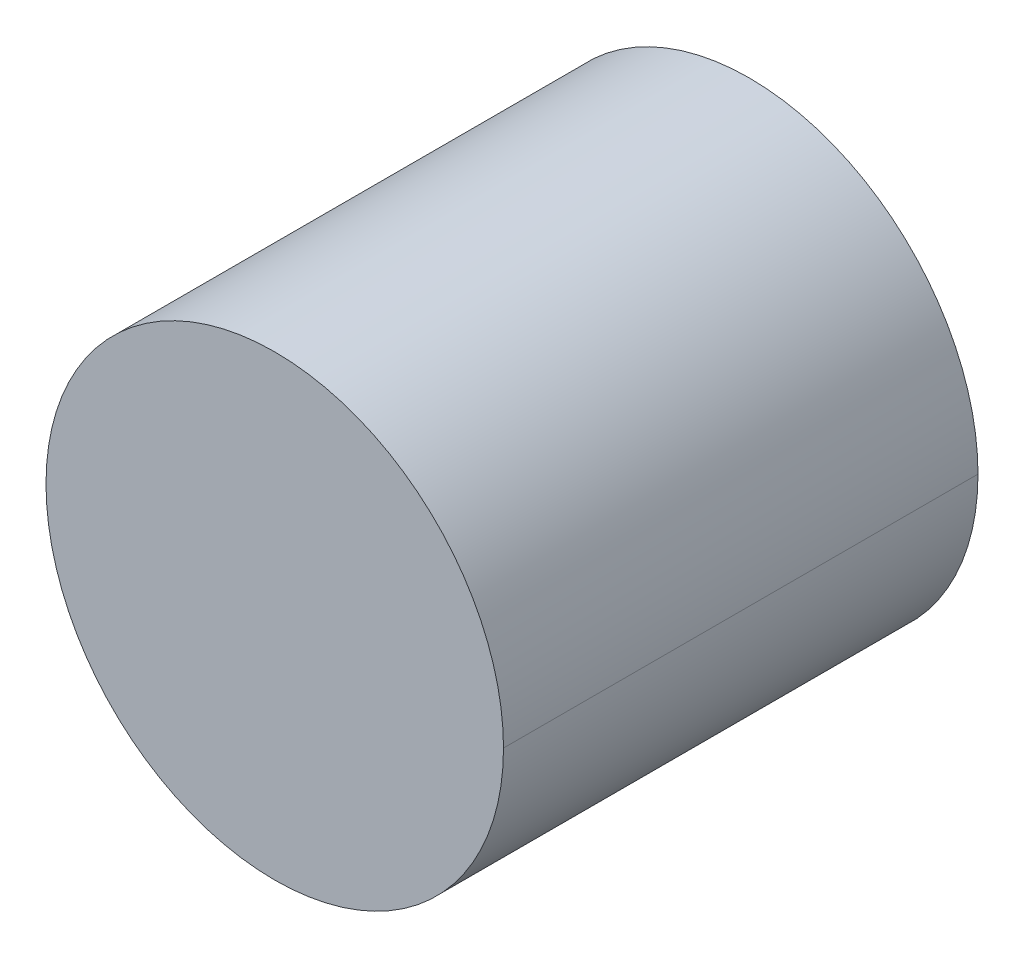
ISO-10303-21;
HEADER;
FILE_DESCRIPTION(('STEP AP214'),'2;1');
FILE_NAME('part.step','',(''),(''),'','','');
FILE_SCHEMA(('AUTOMOTIVE_DESIGN { 1 0 10303 214 1 1 1 1 }'));
ENDSEC;
DATA;
#1=APPLICATION_CONTEXT('core data for automotive mechanical design processes');
#2=APPLICATION_PROTOCOL_DEFINITION('international standard','automotive_design',2000,#1);
#3=PRODUCT_CONTEXT('',#1,'mechanical');
#4=PRODUCT('Part','Part','',(#3));
#5=PRODUCT_RELATED_PRODUCT_CATEGORY('part','',(#4));
#6=PRODUCT_DEFINITION_FORMATION('','',#4);
#7=PRODUCT_DEFINITION_CONTEXT('part definition',#1,'design');
#8=PRODUCT_DEFINITION('design','',#6,#7);
#9=PRODUCT_DEFINITION_SHAPE('','',#8);
#10=(LENGTH_UNIT() NAMED_UNIT(*) SI_UNIT(.MILLI.,.METRE.));
#11=(NAMED_UNIT(*) PLANE_ANGLE_UNIT() SI_UNIT($,.RADIAN.));
#12=(NAMED_UNIT(*) SI_UNIT($,.STERADIAN.) SOLID_ANGLE_UNIT());
#13=UNCERTAINTY_MEASURE_WITH_UNIT(LENGTH_MEASURE(1.E-05),#10,'distance_accuracy_value','');
#14=(GEOMETRIC_REPRESENTATION_CONTEXT(3) GLOBAL_UNCERTAINTY_ASSIGNED_CONTEXT((#13)) GLOBAL_UNIT_ASSIGNED_CONTEXT((#10,
#11,#12)) REPRESENTATION_CONTEXT('',''));
#15=CARTESIAN_POINT('',(0.,0.,0.));
#16=DIRECTION('',(0.,0.,1.));
#17=DIRECTION('',(1.,0.,0.));
#18=AXIS2_PLACEMENT_3D('',#15,#16,#17);
#19=CARTESIAN_POINT('',(-27.18520104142,8.07259102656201,1.600000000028));
#20=DIRECTION('',(0.,0.,1.));
#21=DIRECTION('',(1.,0.,0.));
#22=AXIS2_PLACEMENT_3D('',#19,#20,#21);
#23=PLANE('',#22);
#24=CARTESIAN_POINT('',(-27.18520104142,8.07259102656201,1.600000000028));
#25=DIRECTION('',(0.,0.,1.));
#26=DIRECTION('',(1.,0.,0.));
#27=AXIS2_PLACEMENT_3D('',#24,#25,#26);
#28=CIRCLE('',#27,0.53061223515);
#29=CARTESIAN_POINT('',(-26.65458880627,8.07259102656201,1.600000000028));
#30=VERTEX_POINT('',#29);
#31=CARTESIAN_POINT('',(-27.71581327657,8.07259102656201,1.600000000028));
#32=VERTEX_POINT('',#31);
#33=EDGE_CURVE('E62',#30,#32,#28,.T.);
#34=ORIENTED_EDGE('',*,*,#33,.T.);
#35=CARTESIAN_POINT('',(-27.18520104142,8.07259102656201,1.600000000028));
#36=DIRECTION('',(0.,0.,1.));
#37=DIRECTION('',(1.,0.,0.));
#38=AXIS2_PLACEMENT_3D('',#35,#36,#37);
#39=CIRCLE('',#38,0.53061223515);
#40=EDGE_CURVE('E25',#32,#30,#39,.T.);
#41=ORIENTED_EDGE('',*,*,#40,.T.);
#42=EDGE_LOOP('',(#34,#41));
#43=FACE_BOUND('',#42,.T.);
#44=ADVANCED_FACE('F16',(#43),#23,.T.);
#45=CARTESIAN_POINT('',(-27.18520104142,8.07259102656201,0.49933777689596));
#46=DIRECTION('',(0.,0.,-1.));
#47=DIRECTION('',(0.,-1.,0.));
#48=AXIS2_PLACEMENT_3D('',#45,#46,#47);
#49=PLANE('',#48);
#50=CARTESIAN_POINT('',(-27.18520104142,8.07259102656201,0.49933777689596));
#51=DIRECTION('',(0.,0.,-1.));
#52=DIRECTION('',(1.,0.,0.));
#53=AXIS2_PLACEMENT_3D('',#50,#51,#52);
#54=CIRCLE('',#53,0.53061223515);
#55=CARTESIAN_POINT('',(-26.65458880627,8.07259102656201,0.49933777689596));
#56=VERTEX_POINT('',#55);
#57=CARTESIAN_POINT('',(-27.71581327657,8.07259102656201,0.49933777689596));
#58=VERTEX_POINT('',#57);
#59=EDGE_CURVE('E11',#56,#58,#54,.T.);
#60=ORIENTED_EDGE('',*,*,#59,.T.);
#61=CARTESIAN_POINT('',(-27.18520104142,8.07259102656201,0.49933777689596));
#62=DIRECTION('',(0.,0.,-1.));
#63=DIRECTION('',(1.,0.,0.));
#64=AXIS2_PLACEMENT_3D('',#61,#62,#63);
#65=CIRCLE('',#64,0.53061223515);
#66=EDGE_CURVE('E56',#58,#56,#65,.T.);
#67=ORIENTED_EDGE('',*,*,#66,.T.);
#68=EDGE_LOOP('',(#60,#67));
#69=FACE_BOUND('',#68,.T.);
#70=ADVANCED_FACE('F18',(#69),#49,.T.);
#71=CARTESIAN_POINT('',(-27.18520104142,8.07259102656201,1.04966888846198));
#72=DIRECTION('',(0.,0.,1.));
#73=DIRECTION('',(1.,0.,0.));
#74=AXIS2_PLACEMENT_3D('',#71,#72,#73);
#75=CYLINDRICAL_SURFACE('',#74,0.53061223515);
#76=DIRECTION('',(0.,0.,1.));
#77=VECTOR('',#76,1.);
#78=CARTESIAN_POINT('',(-26.65458880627,8.07259102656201,1.04966888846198));
#79=LINE('',#78,#77);
#80=EDGE_CURVE('E52',#56,#30,#79,.T.);
#81=ORIENTED_EDGE('',*,*,#80,.T.);
#82=ORIENTED_EDGE('',*,*,#40,.F.);
#83=DIRECTION('',(0.,0.,-1.));
#84=VECTOR('',#83,1.);
#85=CARTESIAN_POINT('',(-27.71581327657,8.07259102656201,1.04966888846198));
#86=LINE('',#85,#84);
#87=EDGE_CURVE('E54',#32,#58,#86,.T.);
#88=ORIENTED_EDGE('',*,*,#87,.T.);
#89=ORIENTED_EDGE('',*,*,#59,.F.);
#90=EDGE_LOOP('',(#81,#82,#88,#89));
#91=FACE_BOUND('',#90,.T.);
#92=ADVANCED_FACE('F50',(#91),#75,.T.);
#93=CARTESIAN_POINT('',(-27.18520104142,8.07259102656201,1.04966888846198));
#94=DIRECTION('',(0.,0.,1.));
#95=DIRECTION('',(1.,0.,0.));
#96=AXIS2_PLACEMENT_3D('',#93,#94,#95);
#97=CYLINDRICAL_SURFACE('',#96,0.53061223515);
#98=ORIENTED_EDGE('',*,*,#80,.F.);
#99=ORIENTED_EDGE('',*,*,#66,.F.);
#100=ORIENTED_EDGE('',*,*,#87,.F.);
#101=ORIENTED_EDGE('',*,*,#33,.F.);
#102=EDGE_LOOP('',(#98,#99,#100,#101));
#103=FACE_BOUND('',#102,.T.);
#104=ADVANCED_FACE('F61',(#103),#97,.T.);
#105=CLOSED_SHELL('',(#44,#70,#92,#104));
#106=MANIFOLD_SOLID_BREP('B1',#105);
#107=ADVANCED_BREP_SHAPE_REPRESENTATION('',(#18,#106),#14);
#108=SHAPE_DEFINITION_REPRESENTATION(#9,#107);
ENDSEC;
END-ISO-10303-21;
